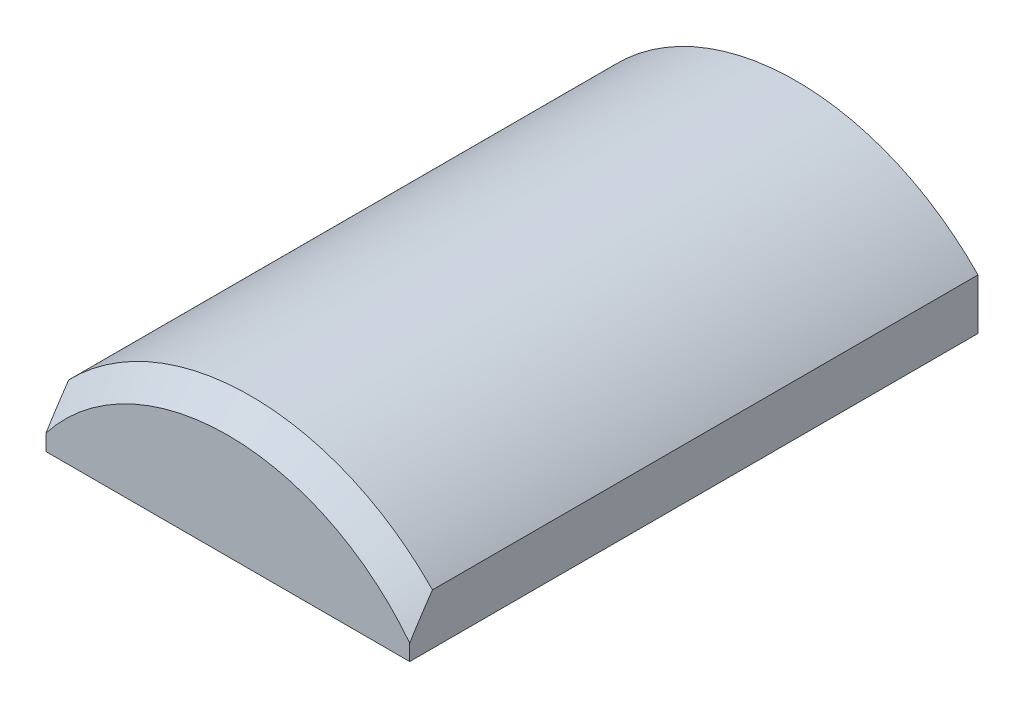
ISO-10303-21;
HEADER;
FILE_DESCRIPTION(('STEP AP214'),'2;1');
FILE_NAME('part.step','',(''),(''),'','','');
FILE_SCHEMA(('AUTOMOTIVE_DESIGN { 1 0 10303 214 1 1 1 1 }'));
ENDSEC;
DATA;
#1=APPLICATION_CONTEXT('core data for automotive mechanical design processes');
#2=APPLICATION_PROTOCOL_DEFINITION('international standard','automotive_design',2000,#1);
#3=PRODUCT_CONTEXT('',#1,'mechanical');
#4=PRODUCT('Part','Part','',(#3));
#5=PRODUCT_RELATED_PRODUCT_CATEGORY('part','',(#4));
#6=PRODUCT_DEFINITION_FORMATION('','',#4);
#7=PRODUCT_DEFINITION_CONTEXT('part definition',#1,'design');
#8=PRODUCT_DEFINITION('design','',#6,#7);
#9=PRODUCT_DEFINITION_SHAPE('','',#8);
#10=(LENGTH_UNIT() NAMED_UNIT(*) SI_UNIT(.MILLI.,.METRE.));
#11=(NAMED_UNIT(*) PLANE_ANGLE_UNIT() SI_UNIT($,.RADIAN.));
#12=(NAMED_UNIT(*) SI_UNIT($,.STERADIAN.) SOLID_ANGLE_UNIT());
#13=UNCERTAINTY_MEASURE_WITH_UNIT(LENGTH_MEASURE(1.E-05),#10,'distance_accuracy_value','');
#14=(GEOMETRIC_REPRESENTATION_CONTEXT(3) GLOBAL_UNCERTAINTY_ASSIGNED_CONTEXT((#13)) GLOBAL_UNIT_ASSIGNED_CONTEXT((#10,
#11,#12)) REPRESENTATION_CONTEXT('',''));
#15=CARTESIAN_POINT('',(0.,0.,0.));
#16=DIRECTION('',(0.,0.,1.));
#17=DIRECTION('',(1.,0.,0.));
#18=AXIS2_PLACEMENT_3D('',#15,#16,#17);
#19=CARTESIAN_POINT('',(0.,0.,317.5));
#20=DIRECTION('',(0.,0.,-1.));
#21=DIRECTION('',(-1.,0.,0.));
#22=AXIS2_PLACEMENT_3D('',#19,#20,#21);
#23=CYLINDRICAL_SURFACE('',#22,141.2875);
#24=DIRECTION('',(0.,0.,-1.));
#25=VECTOR('',#24,1.);
#26=CARTESIAN_POINT('',(-101.6,98.1814527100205,317.5));
#27=LINE('',#26,#25);
#28=CARTESIAN_POINT('',(-101.6,98.1814527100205,304.8));
#29=VERTEX_POINT('',#28);
#30=CARTESIAN_POINT('',(-101.6,98.1814527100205,0.));
#31=VERTEX_POINT('',#30);
#32=EDGE_CURVE('E100',#29,#31,#27,.T.);
#33=ORIENTED_EDGE('',*,*,#32,.F.);
#34=CARTESIAN_POINT('',(0.,0.,304.8));
#35=DIRECTION('',(0.,0.,1.));
#36=DIRECTION('',(1.,0.,0.));
#37=AXIS2_PLACEMENT_3D('',#34,#35,#36);
#38=CIRCLE('',#37,141.2875);
#39=CARTESIAN_POINT('',(101.6,98.1814527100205,304.8));
#40=VERTEX_POINT('',#39);
#41=EDGE_CURVE('E46',#29,#40,#38,.F.);
#42=ORIENTED_EDGE('',*,*,#41,.T.);
#43=DIRECTION('',(0.,0.,-1.));
#44=VECTOR('',#43,1.);
#45=CARTESIAN_POINT('',(101.6,98.1814527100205,317.5));
#46=LINE('',#45,#44);
#47=CARTESIAN_POINT('',(101.6,98.1814527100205,0.));
#48=VERTEX_POINT('',#47);
#49=EDGE_CURVE('E108',#40,#48,#46,.T.);
#50=ORIENTED_EDGE('',*,*,#49,.T.);
#51=CARTESIAN_POINT('',(0.,0.,0.));
#52=DIRECTION('',(0.,0.,1.));
#53=DIRECTION('',(1.,0.,0.));
#54=AXIS2_PLACEMENT_3D('',#51,#52,#53);
#55=CIRCLE('',#54,141.2875);
#56=EDGE_CURVE('E111',#48,#31,#55,.T.);
#57=ORIENTED_EDGE('',*,*,#56,.T.);
#58=EDGE_LOOP('',(#33,#42,#50,#57));
#59=FACE_BOUND('',#58,.T.);
#60=ADVANCED_FACE('F33',(#59),#23,.T.);
#61=CARTESIAN_POINT('',(-101.6,98.1814527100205,317.5));
#62=DIRECTION('',(1.,0.,0.));
#63=DIRECTION('',(0.,0.,-1.));
#64=AXIS2_PLACEMENT_3D('',#61,#62,#63);
#65=PLANE('',#64);
#66=DIRECTION('',(0.,-1.,0.));
#67=VECTOR('',#66,1.);
#68=CARTESIAN_POINT('',(-101.6,98.1814527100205,317.5));
#69=LINE('',#68,#67);
#70=CARTESIAN_POINT('',(-101.6,78.8174165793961,317.5));
#71=VERTEX_POINT('',#70);
#72=CARTESIAN_POINT('',(-101.6,69.85,317.5));
#73=VERTEX_POINT('',#72);
#74=EDGE_CURVE('E82',#71,#73,#69,.T.);
#75=ORIENTED_EDGE('',*,*,#74,.F.);
#76=CARTESIAN_POINT('',(-101.6,78.8174165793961,317.5));
#77=CARTESIAN_POINT('',(-101.6,79.6402772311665,316.995625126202));
#78=CARTESIAN_POINT('',(-101.6,80.4609387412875,316.48767606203));
#79=CARTESIAN_POINT('',(-101.6,82.098021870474,315.465004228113));
#80=CARTESIAN_POINT('',(-101.6,82.9144435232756,314.950281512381));
#81=CARTESIAN_POINT('',(-101.6,85.3572649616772,313.396719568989));
#82=CARTESIAN_POINT('',(-101.6,86.9775655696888,312.348275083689));
#83=CARTESIAN_POINT('',(-101.6,90.2030275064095,310.228500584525));
#84=CARTESIAN_POINT('',(-101.6,91.8081892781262,309.157171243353));
#85=CARTESIAN_POINT('',(-101.6,95.0048643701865,306.99363232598));
#86=CARTESIAN_POINT('',(-101.6,96.5963748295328,305.901418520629));
#87=CARTESIAN_POINT('',(-101.6,98.1814527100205,304.8));
#88=B_SPLINE_CURVE_WITH_KNOTS('',3,(#76,#77,#78,#79,#80,#81,#82,#83,#84,#85,#86,#87),
.UNSPECIFIED.,.F.,.F.,(4,2,2,2,2,4),(0.,2.89539624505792,5.79076941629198,11.580303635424,
17.3696679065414,23.1602172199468),.UNSPECIFIED.);
#89=EDGE_CURVE('E60',#71,#29,#88,.T.);
#90=ORIENTED_EDGE('',*,*,#89,.T.);
#91=ORIENTED_EDGE('',*,*,#32,.T.);
#92=DIRECTION('',(0.,-1.,0.));
#93=VECTOR('',#92,1.);
#94=CARTESIAN_POINT('',(-101.6,98.1814527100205,0.));
#95=LINE('',#94,#93);
#96=CARTESIAN_POINT('',(-101.6,69.85,0.));
#97=VERTEX_POINT('',#96);
#98=EDGE_CURVE('E97',#31,#97,#95,.T.);
#99=ORIENTED_EDGE('',*,*,#98,.T.);
#100=DIRECTION('',(0.,0.,-1.));
#101=VECTOR('',#100,1.);
#102=CARTESIAN_POINT('',(-101.6,69.85,317.5));
#103=LINE('',#102,#101);
#104=EDGE_CURVE('E94',#73,#97,#103,.T.);
#105=ORIENTED_EDGE('',*,*,#104,.F.);
#106=EDGE_LOOP('',(#75,#90,#91,#99,#105));
#107=FACE_BOUND('',#106,.T.);
#108=ADVANCED_FACE('F95',(#107),#65,.F.);
#109=CARTESIAN_POINT('',(-101.6,69.85,317.5));
#110=DIRECTION('',(0.,1.,0.));
#111=DIRECTION('',(0.,0.,1.));
#112=AXIS2_PLACEMENT_3D('',#109,#110,#111);
#113=PLANE('',#112);
#114=DIRECTION('',(1.,0.,0.));
#115=VECTOR('',#114,1.);
#116=CARTESIAN_POINT('',(-101.6,69.85,0.));
#117=LINE('',#116,#115);
#118=CARTESIAN_POINT('',(101.6,69.85,0.));
#119=VERTEX_POINT('',#118);
#120=EDGE_CURVE('E115',#97,#119,#117,.T.);
#121=ORIENTED_EDGE('',*,*,#120,.T.);
#122=DIRECTION('',(0.,0.,-1.));
#123=VECTOR('',#122,1.);
#124=CARTESIAN_POINT('',(101.6,69.85,317.5));
#125=LINE('',#124,#123);
#126=CARTESIAN_POINT('',(101.6,69.85,317.5));
#127=VERTEX_POINT('',#126);
#128=EDGE_CURVE('E101',#127,#119,#125,.T.);
#129=ORIENTED_EDGE('',*,*,#128,.F.);
#130=DIRECTION('',(1.,0.,0.));
#131=VECTOR('',#130,1.);
#132=CARTESIAN_POINT('',(-101.6,69.85,317.5));
#133=LINE('',#132,#131);
#134=EDGE_CURVE('E87',#73,#127,#133,.T.);
#135=ORIENTED_EDGE('',*,*,#134,.F.);
#136=ORIENTED_EDGE('',*,*,#104,.T.);
#137=EDGE_LOOP('',(#121,#129,#135,#136));
#138=FACE_BOUND('',#137,.T.);
#139=ADVANCED_FACE('F103',(#138),#113,.F.);
#140=CARTESIAN_POINT('',(101.6,69.85,317.5));
#141=DIRECTION('',(-1.,0.,0.));
#142=DIRECTION('',(0.,0.,1.));
#143=AXIS2_PLACEMENT_3D('',#140,#141,#142);
#144=PLANE('',#143);
#145=ORIENTED_EDGE('',*,*,#49,.F.);
#146=CARTESIAN_POINT('',(101.6,98.1814527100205,304.8));
#147=CARTESIAN_POINT('',(101.6,96.5963748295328,305.901418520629));
#148=CARTESIAN_POINT('',(101.6,95.0048643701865,306.99363232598));
#149=CARTESIAN_POINT('',(101.6,91.8081892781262,309.157171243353));
#150=CARTESIAN_POINT('',(101.6,90.2030275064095,310.228500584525));
#151=CARTESIAN_POINT('',(101.6,86.9775655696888,312.348275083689));
#152=CARTESIAN_POINT('',(101.6,85.3572649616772,313.396719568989));
#153=CARTESIAN_POINT('',(101.6,82.9144435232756,314.950281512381));
#154=CARTESIAN_POINT('',(101.6,82.098021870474,315.465004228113));
#155=CARTESIAN_POINT('',(101.6,80.4609387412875,316.48767606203));
#156=CARTESIAN_POINT('',(101.6,79.6402772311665,316.995625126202));
#157=CARTESIAN_POINT('',(101.6,78.8174165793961,317.5));
#158=B_SPLINE_CURVE_WITH_KNOTS('',3,(#146,#147,#148,#149,#150,#151,#152,#153,#154,#155,#156,
#157),.UNSPECIFIED.,.F.,.F.,(4,2,2,2,2,4),(0.,5.79054931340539,11.5799135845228,
17.3694478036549,20.2648209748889,23.1602172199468),.UNSPECIFIED.);
#159=CARTESIAN_POINT('',(101.6,78.8174165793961,317.5));
#160=VERTEX_POINT('',#159);
#161=EDGE_CURVE('E11',#40,#160,#158,.T.);
#162=ORIENTED_EDGE('',*,*,#161,.T.);
#163=DIRECTION('',(0.,1.,0.));
#164=VECTOR('',#163,1.);
#165=CARTESIAN_POINT('',(101.6,69.85,317.5));
#166=LINE('',#165,#164);
#167=EDGE_CURVE('E106',#127,#160,#166,.T.);
#168=ORIENTED_EDGE('',*,*,#167,.F.);
#169=ORIENTED_EDGE('',*,*,#128,.T.);
#170=DIRECTION('',(0.,1.,0.));
#171=VECTOR('',#170,1.);
#172=CARTESIAN_POINT('',(101.6,69.85,0.));
#173=LINE('',#172,#171);
#174=EDGE_CURVE('E91',#119,#48,#173,.T.);
#175=ORIENTED_EDGE('',*,*,#174,.T.);
#176=EDGE_LOOP('',(#145,#162,#168,#169,#175));
#177=FACE_BOUND('',#176,.T.);
#178=ADVANCED_FACE('F137',(#177),#144,.F.);
#179=CARTESIAN_POINT('',(0.,0.,317.5));
#180=DIRECTION('',(0.,0.,1.));
#181=DIRECTION('',(1.,0.,0.));
#182=AXIS2_PLACEMENT_3D('',#179,#180,#181);
#183=PLANE('',#182);
#184=ORIENTED_EDGE('',*,*,#167,.T.);
#185=CARTESIAN_POINT('',(0.,0.,317.5));
#186=DIRECTION('',(0.,0.,1.));
#187=DIRECTION('',(1.,0.,0.));
#188=AXIS2_PLACEMENT_3D('',#185,#186,#187);
#189=CIRCLE('',#188,128.5875);
#190=EDGE_CURVE('E90',#160,#71,#189,.T.);
#191=ORIENTED_EDGE('',*,*,#190,.T.);
#192=ORIENTED_EDGE('',*,*,#74,.T.);
#193=ORIENTED_EDGE('',*,*,#134,.T.);
#194=EDGE_LOOP('',(#184,#191,#192,#193));
#195=FACE_BOUND('',#194,.T.);
#196=ADVANCED_FACE('F85',(#195),#183,.T.);
#197=CARTESIAN_POINT('',(0.,0.,0.));
#198=DIRECTION('',(0.,0.,1.));
#199=DIRECTION('',(1.,0.,0.));
#200=AXIS2_PLACEMENT_3D('',#197,#198,#199);
#201=PLANE('',#200);
#202=ORIENTED_EDGE('',*,*,#56,.F.);
#203=ORIENTED_EDGE('',*,*,#174,.F.);
#204=ORIENTED_EDGE('',*,*,#120,.F.);
#205=ORIENTED_EDGE('',*,*,#98,.F.);
#206=EDGE_LOOP('',(#202,#203,#204,#205));
#207=FACE_BOUND('',#206,.T.);
#208=ADVANCED_FACE('F140',(#207),#201,.F.);
#209=CARTESIAN_POINT('',(0.,0.,317.5));
#210=DIRECTION('',(0.,0.,-1.));
#211=DIRECTION('',(-1.,0.,0.));
#212=AXIS2_PLACEMENT_3D('',#209,#210,#211);
#213=CONICAL_SURFACE('',#212,128.5875,0.785398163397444);
#214=ORIENTED_EDGE('',*,*,#161,.F.);
#215=ORIENTED_EDGE('',*,*,#41,.F.);
#216=ORIENTED_EDGE('',*,*,#89,.F.);
#217=ORIENTED_EDGE('',*,*,#190,.F.);
#218=EDGE_LOOP('',(#214,#215,#216,#217));
#219=FACE_BOUND('',#218,.T.);
#220=ADVANCED_FACE('F35',(#219),#213,.T.);
#221=CLOSED_SHELL('',(#60,#108,#139,#178,#196,#208,#220));
#222=MANIFOLD_SOLID_BREP('B2',#221);
#223=ADVANCED_BREP_SHAPE_REPRESENTATION('',(#18,#222),#14);
#224=SHAPE_DEFINITION_REPRESENTATION(#9,#223);
ENDSEC;
END-ISO-10303-21;
